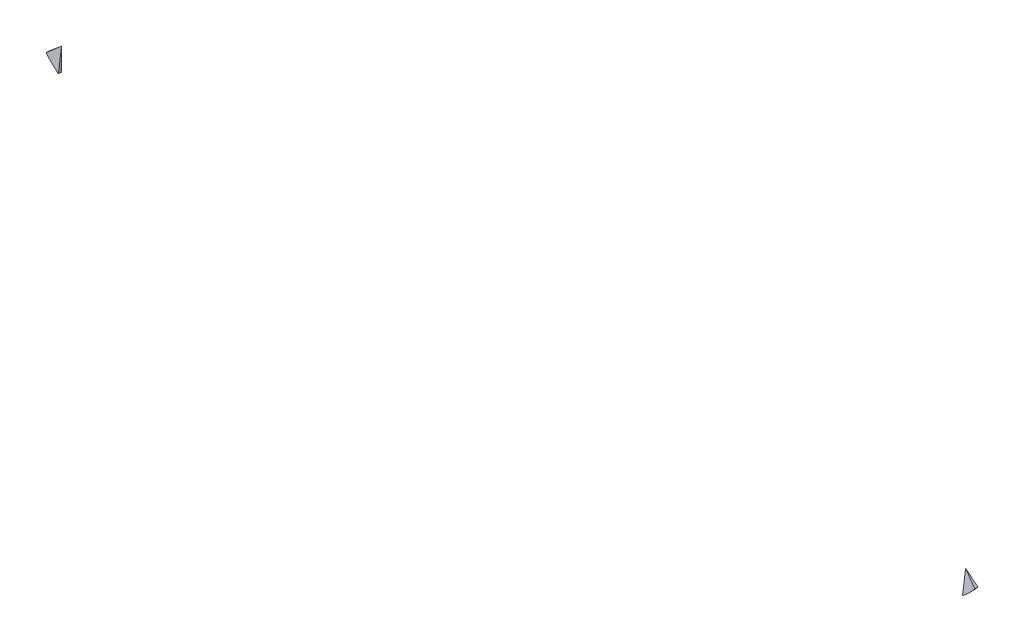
ISO-10303-21;
HEADER;
FILE_DESCRIPTION(('STEP AP214'),'2;1');
FILE_NAME('part.step','',(''),(''),'','','');
FILE_SCHEMA(('AUTOMOTIVE_DESIGN { 1 0 10303 214 1 1 1 1 }'));
ENDSEC;
DATA;
#1=APPLICATION_CONTEXT('core data for automotive mechanical design processes');
#2=APPLICATION_PROTOCOL_DEFINITION('international standard','automotive_design',2000,#1);
#3=PRODUCT_CONTEXT('',#1,'mechanical');
#4=PRODUCT('Part','Part','',(#3));
#5=PRODUCT_RELATED_PRODUCT_CATEGORY('part','',(#4));
#6=PRODUCT_DEFINITION_FORMATION('','',#4);
#7=PRODUCT_DEFINITION_CONTEXT('part definition',#1,'design');
#8=PRODUCT_DEFINITION('design','',#6,#7);
#9=PRODUCT_DEFINITION_SHAPE('','',#8);
#10=(LENGTH_UNIT() NAMED_UNIT(*) SI_UNIT(.MILLI.,.METRE.));
#11=(NAMED_UNIT(*) PLANE_ANGLE_UNIT() SI_UNIT($,.RADIAN.));
#12=(NAMED_UNIT(*) SI_UNIT($,.STERADIAN.) SOLID_ANGLE_UNIT());
#13=UNCERTAINTY_MEASURE_WITH_UNIT(LENGTH_MEASURE(1.E-05),#10,'distance_accuracy_value','');
#14=(GEOMETRIC_REPRESENTATION_CONTEXT(3) GLOBAL_UNCERTAINTY_ASSIGNED_CONTEXT((#13)) GLOBAL_UNIT_ASSIGNED_CONTEXT((#10,
#11,#12)) REPRESENTATION_CONTEXT('',''));
#15=CARTESIAN_POINT('',(0.,0.,0.));
#16=DIRECTION('',(0.,0.,1.));
#17=DIRECTION('',(1.,0.,0.));
#18=AXIS2_PLACEMENT_3D('',#15,#16,#17);
#19=CARTESIAN_POINT('',(3.508304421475,3.766411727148,23.91));
#20=DIRECTION('',(0.,0.,-1.));
#21=DIRECTION('',(-1.,0.,0.));
#22=AXIS2_PLACEMENT_3D('',#19,#20,#21);
#23=PLANE('',#22);
#24=DIRECTION('',(0.,1.,0.));
#25=VECTOR('',#24,1.);
#26=CARTESIAN_POINT('',(3.506155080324,3.08359672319,23.91));
#27=LINE('',#26,#25);
#28=CARTESIAN_POINT('',(3.50615508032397,3.25789858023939,23.9100000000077));
#29=VERTEX_POINT('',#28);
#30=CARTESIAN_POINT('',(3.50615508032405,3.08359672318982,23.91));
#31=VERTEX_POINT('',#30);
#32=EDGE_CURVE('P0_E49',#29,#31,#27,.F.);
#33=ORIENTED_EDGE('',*,*,#32,.F.);
#34=DIRECTION('',(0.768221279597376,-0.64018439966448,0.));
#35=VECTOR('',#34,1.);
#36=CARTESIAN_POINT('',(3.575220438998,3.200344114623,23.91));
#37=LINE('',#36,#35);
#38=CARTESIAN_POINT('',(3.60218274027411,3.17787553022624,23.91));
#39=VERTEX_POINT('',#38);
#40=EDGE_CURVE('P0_E54',#29,#39,#37,.T.);
#41=ORIENTED_EDGE('',*,*,#40,.T.);
#42=CARTESIAN_POINT('',(3.083633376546,3.61,23.91));
#43=DIRECTION('',(0.,0.,-1.));
#44=DIRECTION('',(-1.,0.,0.));
#45=AXIS2_PLACEMENT_3D('',#42,#43,#44);
#46=CIRCLE('',#45,0.675);
#47=EDGE_CURVE('P0_E23',#31,#39,#46,.F.);
#48=ORIENTED_EDGE('',*,*,#47,.F.);
#49=EDGE_LOOP('',(#33,#41,#48));
#50=FACE_BOUND('',#49,.T.);
#51=ADVANCED_FACE('P0_F16',(#50),#23,.T.);
#52=CARTESIAN_POINT('',(3.506155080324,3.08359672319,24.41));
#53=DIRECTION('',(-1.,0.,0.));
#54=DIRECTION('',(0.,0.,1.));
#55=AXIS2_PLACEMENT_3D('',#52,#53,#54);
#56=PLANE('',#55);
#57=DIRECTION('',(0.,0.,-1.));
#58=VECTOR('',#57,1.);
#59=CARTESIAN_POINT('',(3.50615508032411,3.08359672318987,24.41));
#60=LINE('',#59,#58);
#61=CARTESIAN_POINT('',(3.50615508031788,3.08359672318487,23.9345919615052));
#62=VERTEX_POINT('',#61);
#63=EDGE_CURVE('P0_E56',#62,#31,#60,.T.);
#64=ORIENTED_EDGE('',*,*,#63,.F.);
#65=DIRECTION('',(-1.4096940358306E-11,-0.990193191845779,0.139704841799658));
#66=VECTOR('',#65,1.);
#67=CARTESIAN_POINT('',(3.50615508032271,3.17074467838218,23.9222964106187));
#68=LINE('',#67,#66);
#69=EDGE_CURVE('P0_E59',#29,#62,#68,.T.);
#70=ORIENTED_EDGE('',*,*,#69,.F.);
#71=ORIENTED_EDGE('',*,*,#32,.T.);
#72=EDGE_LOOP('',(#64,#70,#71));
#73=FACE_BOUND('',#72,.T.);
#74=ADVANCED_FACE('P0_F60',(#73),#56,.T.);
#75=CARTESIAN_POINT('',(3.083633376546,3.61,24.41));
#76=DIRECTION('',(0.,0.,-1.));
#77=DIRECTION('',(-1.,0.,0.));
#78=AXIS2_PLACEMENT_3D('',#75,#76,#77);
#79=CYLINDRICAL_SURFACE('',#78,0.675);
#80=ORIENTED_EDGE('',*,*,#47,.T.);
#81=DIRECTION('',(0.,0.,1.));
#82=VECTOR('',#81,1.);
#83=CARTESIAN_POINT('',(3.60218274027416,3.1778755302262,24.1325970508));
#84=LINE('',#83,#82);
#85=CARTESIAN_POINT('',(3.60218262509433,3.17787562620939,23.9345920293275));
#86=VERTEX_POINT('',#85);
#87=EDGE_CURVE('P0_E38',#39,#86,#84,.T.);
#88=ORIENTED_EDGE('',*,*,#87,.T.);
#89=CARTESIAN_POINT('',(3.50615508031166,3.08359672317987,23.9345919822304));
#90=CARTESIAN_POINT('',(3.51709122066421,3.09237344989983,23.9345925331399));
#91=CARTESIAN_POINT('',(3.52775299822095,3.10149249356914,23.9345929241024));
#92=CARTESIAN_POINT('',(3.5495199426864,3.1213161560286,23.9345933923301));
#93=CARTESIAN_POINT('',(3.56056371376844,3.13208826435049,23.9345934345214));
#94=CARTESIAN_POINT('',(3.58193883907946,3.15441554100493,23.9345930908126));
#95=CARTESIAN_POINT('',(3.59226657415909,3.1659741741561,23.9345927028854));
#96=CARTESIAN_POINT('',(3.60218281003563,3.17787561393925,23.9345920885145));
#97=B_SPLINE_CURVE_WITH_KNOTS('',3,(#89,#90,#91,#92,#93,#94,#95,#96),.UNSPECIFIED.,.F.,.F.,(4,2,
2,4),(0.,0.0420615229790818,0.0883071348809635,0.134771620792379),.UNSPECIFIED.);
#98=EDGE_CURVE('P0_E29',#62,#86,#97,.T.);
#99=ORIENTED_EDGE('',*,*,#98,.F.);
#100=ORIENTED_EDGE('',*,*,#63,.T.);
#101=EDGE_LOOP('',(#80,#88,#99,#100));
#102=FACE_BOUND('',#101,.T.);
#103=ADVANCED_FACE('P0_F77',(#102),#79,.T.);
#104=CARTESIAN_POINT('',(3.575220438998,3.200344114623,24.1325970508));
#105=DIRECTION('',(-0.64018439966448,-0.768221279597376,0.));
#106=DIRECTION('',(0.768221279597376,-0.64018439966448,0.));
#107=AXIS2_PLACEMENT_3D('',#104,#105,#106);
#108=PLANE('',#107);
#109=ORIENTED_EDGE('',*,*,#40,.F.);
#110=CARTESIAN_POINT('',(3.6021825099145,3.17787572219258,23.9345920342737));
#111=CARTESIAN_POINT('',(3.59159015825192,3.18670268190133,23.932090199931));
#112=CARTESIAN_POINT('',(3.58100198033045,3.19552616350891,23.9295532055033));
#113=CARTESIAN_POINT('',(3.5596853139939,3.21329005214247,23.924306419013));
#114=CARTESIAN_POINT('',(3.54895712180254,3.22223021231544,23.9215945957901));
#115=CARTESIAN_POINT('',(3.52753042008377,3.2400857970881,23.9159668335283));
#116=CARTESIAN_POINT('',(3.5168319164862,3.24900121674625,23.9130508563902));
#117=CARTESIAN_POINT('',(3.5061550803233,3.25789858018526,23.9100000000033));
#118=B_SPLINE_CURVE_WITH_KNOTS('',3,(#110,#111,#112,#113,#114,#115,#116,#117),.UNSPECIFIED.,.F.,
.F.,(4,2,2,4),(0.,0.0420414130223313,0.0847178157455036,0.127402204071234),.UNSPECIFIED.);
#119=EDGE_CURVE('P0_E11',#86,#29,#118,.T.);
#120=ORIENTED_EDGE('',*,*,#119,.F.);
#121=ORIENTED_EDGE('',*,*,#87,.F.);
#122=EDGE_LOOP('',(#109,#120,#121));
#123=FACE_BOUND('',#122,.T.);
#124=ADVANCED_FACE('P0_F65',(#123),#108,.F.);
#125=CARTESIAN_POINT('',(3.494001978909,3.062087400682,23.93631188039));
#126=CARTESIAN_POINT('',(3.495483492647,3.128296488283,23.92696823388));
#127=CARTESIAN_POINT('',(3.496965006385,3.194505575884,23.91762458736));
#128=CARTESIAN_POINT('',(3.498446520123,3.260714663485,23.90828094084));
#129=CARTESIAN_POINT('',(3.498087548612,3.065148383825,23.93631188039));
#130=CARTESIAN_POINT('',(3.499075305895,3.131368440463,23.92696823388));
#131=CARTESIAN_POINT('',(3.500063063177,3.1975884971,23.91762458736));
#132=CARTESIAN_POINT('',(3.50105082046,3.263808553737,23.90828094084));
#133=CARTESIAN_POINT('',(3.538302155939,3.095984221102,23.93631188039));
#134=CARTESIAN_POINT('',(3.534387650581,3.162258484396,23.92696823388));
#135=CARTESIAN_POINT('',(3.530473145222,3.228532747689,23.91762458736));
#136=CARTESIAN_POINT('',(3.526558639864,3.294807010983,23.90828094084));
#137=CARTESIAN_POINT('',(3.57873652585,3.134806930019,23.93631188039));
#138=CARTESIAN_POINT('',(3.569426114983,3.200540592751,23.92696823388));
#139=CARTESIAN_POINT('',(3.560115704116,3.266274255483,23.91762458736));
#140=CARTESIAN_POINT('',(3.550805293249,3.332007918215,23.90828094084));
#141=CARTESIAN_POINT('',(3.611181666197,3.173734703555,23.93631188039));
#142=CARTESIAN_POINT('',(3.597077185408,3.238442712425,23.92696823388));
#143=CARTESIAN_POINT('',(3.582972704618,3.303150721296,23.91762458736));
#144=CARTESIAN_POINT('',(3.568868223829,3.367858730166,23.90828094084));
#145=CARTESIAN_POINT('',(3.614406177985,3.177692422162,23.93631188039));
#146=CARTESIAN_POINT('',(3.599819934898,3.242291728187,23.92696823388));
#147=CARTESIAN_POINT('',(3.585233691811,3.306891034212,23.91762458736));
#148=CARTESIAN_POINT('',(3.570647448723,3.371490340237,23.90828094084));
#149=B_SPLINE_SURFACE_WITH_KNOTS('',3,3,((#125,#126,#127,#128),(#129,#130,#131,#132),(#133,#134,
#135,#136),(#137,#138,#139,#140),(#141,#142,#143,#144),(#145,#146,#147,#148)),.UNSPECIFIED.,.F.,
.F.,.F.,(4,1,1,4),(4,4),(-0.1120319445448,0.,1.,1.112030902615),(-2.737955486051E-05,
1.000000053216),.UNSPECIFIED.);
#150=ORIENTED_EDGE('',*,*,#98,.T.);
#151=ORIENTED_EDGE('',*,*,#119,.T.);
#152=ORIENTED_EDGE('',*,*,#69,.T.);
#153=EDGE_LOOP('',(#150,#151,#152));
#154=FACE_BOUND('',#153,.T.);
#155=ADVANCED_FACE('P0_F18',(#154),#149,.T.);
#156=CLOSED_SHELL('',(#51,#74,#103,#124,#155));
#157=MANIFOLD_SOLID_BREP('P0_B1',#156);
#158=CARTESIAN_POINT('',(-3.508304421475,3.766411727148,23.91));
#159=DIRECTION('',(0.,0.,1.));
#160=DIRECTION('',(1.,0.,0.));
#161=AXIS2_PLACEMENT_3D('',#158,#159,#160);
#162=PLANE('',#161);
#163=CARTESIAN_POINT('',(-3.083633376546,3.61,23.91));
#164=DIRECTION('',(0.,0.,1.));
#165=DIRECTION('',(1.,0.,0.));
#166=AXIS2_PLACEMENT_3D('',#163,#164,#165);
#167=CIRCLE('',#166,0.675);
#168=CARTESIAN_POINT('',(-3.60218279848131,3.17787560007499,23.91));
#169=VERTEX_POINT('',#168);
#170=CARTESIAN_POINT('',(-3.50615508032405,3.08359672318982,23.91));
#171=VERTEX_POINT('',#170);
#172=EDGE_CURVE('P1_E23',#169,#171,#167,.T.);
#173=ORIENTED_EDGE('',*,*,#172,.F.);
#174=DIRECTION('',(-0.768221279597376,-0.64018439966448,0.));
#175=VECTOR('',#174,1.);
#176=CARTESIAN_POINT('',(-3.575220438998,3.200344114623,23.91));
#177=LINE('',#176,#175);
#178=CARTESIAN_POINT('',(-3.50615508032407,3.25789858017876,23.91));
#179=VERTEX_POINT('',#178);
#180=EDGE_CURVE('P1_E50',#179,#169,#177,.T.);
#181=ORIENTED_EDGE('',*,*,#180,.F.);
#182=DIRECTION('',(0.,1.,0.));
#183=VECTOR('',#182,1.);
#184=CARTESIAN_POINT('',(-3.506155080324,3.08359672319,23.91));
#185=LINE('',#184,#183);
#186=EDGE_CURVE('P1_E57',#179,#171,#185,.F.);
#187=ORIENTED_EDGE('',*,*,#186,.T.);
#188=EDGE_LOOP('',(#173,#181,#187));
#189=FACE_BOUND('',#188,.T.);
#190=ADVANCED_FACE('P1_F16',(#189),#162,.F.);
#191=CARTESIAN_POINT('',(-3.575220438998,3.200344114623,24.1325970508));
#192=DIRECTION('',(-0.64018439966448,0.768221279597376,0.));
#193=DIRECTION('',(-0.768221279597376,-0.64018439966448,0.));
#194=AXIS2_PLACEMENT_3D('',#191,#192,#193);
#195=PLANE('',#194);
#196=DIRECTION('',(0.,0.,1.));
#197=VECTOR('',#196,1.);
#198=CARTESIAN_POINT('',(-3.60218285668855,3.17787566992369,24.41));
#199=LINE('',#198,#197);
#200=CARTESIAN_POINT('',(-3.60218268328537,3.1778756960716,23.9345920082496));
#201=VERTEX_POINT('',#200);
#202=EDGE_CURVE('P1_E55',#201,#169,#199,.F.);
#203=ORIENTED_EDGE('',*,*,#202,.F.);
#204=CARTESIAN_POINT('',(-3.60218250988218,3.17787572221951,23.9345920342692));
#205=CARTESIAN_POINT('',(-3.59159015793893,3.18670268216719,23.9320901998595));
#206=CARTESIAN_POINT('',(-3.58100197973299,3.19552616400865,23.9295532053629));
#207=CARTESIAN_POINT('',(-3.55968531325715,3.21329005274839,23.9243064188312));
#208=CARTESIAN_POINT('',(-3.54895712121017,3.2222302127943,23.9215945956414));
#209=CARTESIAN_POINT('',(-3.52753041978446,3.24008579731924,23.9159668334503));
#210=CARTESIAN_POINT('',(-3.51683191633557,3.24900121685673,23.9130508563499));
#211=CARTESIAN_POINT('',(-3.50615508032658,3.25789858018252,23.9100000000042));
#212=B_SPLINE_CURVE_WITH_KNOTS('',3,(#204,#205,#206,#207,#208,#209,#210,#211),.UNSPECIFIED.,.F.,
.F.,(4,2,2,4),(0.,0.0420414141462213,0.0847178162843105,0.127402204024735),.UNSPECIFIED.);
#213=EDGE_CURVE('P1_E63',#201,#179,#212,.T.);
#214=ORIENTED_EDGE('',*,*,#213,.T.);
#215=ORIENTED_EDGE('',*,*,#180,.T.);
#216=EDGE_LOOP('',(#203,#214,#215));
#217=FACE_BOUND('',#216,.T.);
#218=ADVANCED_FACE('P1_F82',(#217),#195,.T.);
#219=CARTESIAN_POINT('',(-3.506155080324,3.08359672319,24.41));
#220=DIRECTION('',(-1.,0.,0.));
#221=DIRECTION('',(0.,0.,1.));
#222=AXIS2_PLACEMENT_3D('',#219,#220,#221);
#223=PLANE('',#222);
#224=ORIENTED_EDGE('',*,*,#186,.F.);
#225=DIRECTION('',(1.24369510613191E-11,-0.990193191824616,0.139704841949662));
#226=VECTOR('',#225,1.);
#227=CARTESIAN_POINT('',(-3.50615508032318,3.17074467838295,23.922296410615));
#228=LINE('',#227,#226);
#229=CARTESIAN_POINT('',(-3.50615508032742,3.08359672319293,23.9345919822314));
#230=VERTEX_POINT('',#229);
#231=EDGE_CURVE('P1_E29',#179,#230,#228,.T.);
#232=ORIENTED_EDGE('',*,*,#231,.T.);
#233=DIRECTION('',(0.,0.,1.));
#234=VECTOR('',#233,1.);
#235=CARTESIAN_POINT('',(-3.50615508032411,3.08359672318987,24.41));
#236=LINE('',#235,#234);
#237=EDGE_CURVE('P1_E37',#171,#230,#236,.T.);
#238=ORIENTED_EDGE('',*,*,#237,.F.);
#239=EDGE_LOOP('',(#224,#232,#238));
#240=FACE_BOUND('',#239,.T.);
#241=ADVANCED_FACE('P1_F62',(#240),#223,.F.);
#242=CARTESIAN_POINT('',(-3.083633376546,3.61,24.41));
#243=DIRECTION('',(0.,0.,1.));
#244=DIRECTION('',(1.,0.,0.));
#245=AXIS2_PLACEMENT_3D('',#242,#243,#244);
#246=CYLINDRICAL_SURFACE('',#245,0.675);
#247=ORIENTED_EDGE('',*,*,#237,.T.);
#248=CARTESIAN_POINT('',(-3.50615508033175,3.083596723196,23.934591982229));
#249=CARTESIAN_POINT('',(-3.51709122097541,3.09237345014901,23.9345925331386));
#250=CARTESIAN_POINT('',(-3.52775299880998,3.10149249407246,23.9345929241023));
#251=CARTESIAN_POINT('',(-3.54951995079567,3.12131616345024,23.9345933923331));
#252=CARTESIAN_POINT('',(-3.56056372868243,3.13208827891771,23.9345934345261));
#253=CARTESIAN_POINT('',(-3.58193886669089,3.15441557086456,23.9345930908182));
#254=CARTESIAN_POINT('',(-3.59226660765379,3.16597421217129,23.9345927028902));
#255=CARTESIAN_POINT('',(-3.60218284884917,3.17787566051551,23.9345920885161));
#256=B_SPLINE_CURVE_WITH_KNOTS('',3,(#248,#249,#250,#251,#252,#253,#254,#255),.UNSPECIFIED.,.F.,
.F.,(4,2,2,4),(0.,0.0420615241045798,0.0883071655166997,0.134771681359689),.UNSPECIFIED.);
#257=EDGE_CURVE('P1_E11',#230,#201,#256,.T.);
#258=ORIENTED_EDGE('',*,*,#257,.T.);
#259=ORIENTED_EDGE('',*,*,#202,.T.);
#260=ORIENTED_EDGE('',*,*,#172,.T.);
#261=EDGE_LOOP('',(#247,#258,#259,#260));
#262=FACE_BOUND('',#261,.T.);
#263=ADVANCED_FACE('P1_F54',(#262),#246,.T.);
#264=CARTESIAN_POINT('',(-3.494001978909,3.062087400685,23.93631188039));
#265=CARTESIAN_POINT('',(-3.495483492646,3.128296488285,23.92696823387));
#266=CARTESIAN_POINT('',(-3.496965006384,3.194505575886,23.91762458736));
#267=CARTESIAN_POINT('',(-3.498446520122,3.260714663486,23.90828094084));
#268=CARTESIAN_POINT('',(-3.498087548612,3.065148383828,23.93631188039));
#269=CARTESIAN_POINT('',(-3.499075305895,3.131368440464,23.92696823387));
#270=CARTESIAN_POINT('',(-3.500063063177,3.197588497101,23.91762458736));
#271=CARTESIAN_POINT('',(-3.501050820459,3.263808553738,23.90828094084));
#272=CARTESIAN_POINT('',(-3.53830225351,3.095984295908,23.93631188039));
#273=CARTESIAN_POINT('',(-3.534387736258,3.162258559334,23.92696823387));
#274=CARTESIAN_POINT('',(-3.530473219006,3.22853282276,23.91762458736));
#275=CARTESIAN_POINT('',(-3.526558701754,3.294807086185,23.90828094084));
#276=CARTESIAN_POINT('',(-3.578736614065,3.134807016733,23.93631188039));
#277=CARTESIAN_POINT('',(-3.569426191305,3.200540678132,23.92696823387));
#278=CARTESIAN_POINT('',(-3.560115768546,3.266274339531,23.91762458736));
#279=CARTESIAN_POINT('',(-3.550805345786,3.33200800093,23.90828094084));
#280=CARTESIAN_POINT('',(-3.611181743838,3.173734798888,23.93631188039));
#281=CARTESIAN_POINT('',(-3.597077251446,3.238442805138,23.92696823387));
#282=CARTESIAN_POINT('',(-3.582972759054,3.303150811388,23.91762458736));
#283=CARTESIAN_POINT('',(-3.568868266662,3.367858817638,23.90828094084));
#284=CARTESIAN_POINT('',(-3.614406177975,3.177692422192,23.93631188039));
#285=CARTESIAN_POINT('',(-3.599819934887,3.242291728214,23.92696823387));
#286=CARTESIAN_POINT('',(-3.585233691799,3.306891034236,23.91762458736));
#287=CARTESIAN_POINT('',(-3.57064744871,3.371490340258,23.90828094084));
#288=B_SPLINE_SURFACE_WITH_KNOTS('',3,3,((#264,#265,#266,#267),(#268,#269,#270,#271),(#272,#273,
#274,#275),(#276,#277,#278,#279),(#280,#281,#282,#283),(#284,#285,#286,#287)),.UNSPECIFIED.,.F.,
.F.,.F.,(4,1,1,4),(4,4),(-0.1120316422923,0.,1.,1.112027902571),(-2.737553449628E-05,
1.000000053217),.UNSPECIFIED.);
#289=ORIENTED_EDGE('',*,*,#231,.F.);
#290=ORIENTED_EDGE('',*,*,#213,.F.);
#291=ORIENTED_EDGE('',*,*,#257,.F.);
#292=EDGE_LOOP('',(#289,#290,#291));
#293=FACE_BOUND('',#292,.T.);
#294=ADVANCED_FACE('P1_F18',(#293),#288,.F.);
#295=CLOSED_SHELL('',(#190,#218,#241,#263,#294));
#296=MANIFOLD_SOLID_BREP('P1_B1',#295);
#297=ADVANCED_BREP_SHAPE_REPRESENTATION('',(#18,#157,#296),#14);
#298=SHAPE_DEFINITION_REPRESENTATION(#9,#297);
ENDSEC;
END-ISO-10303-21;
